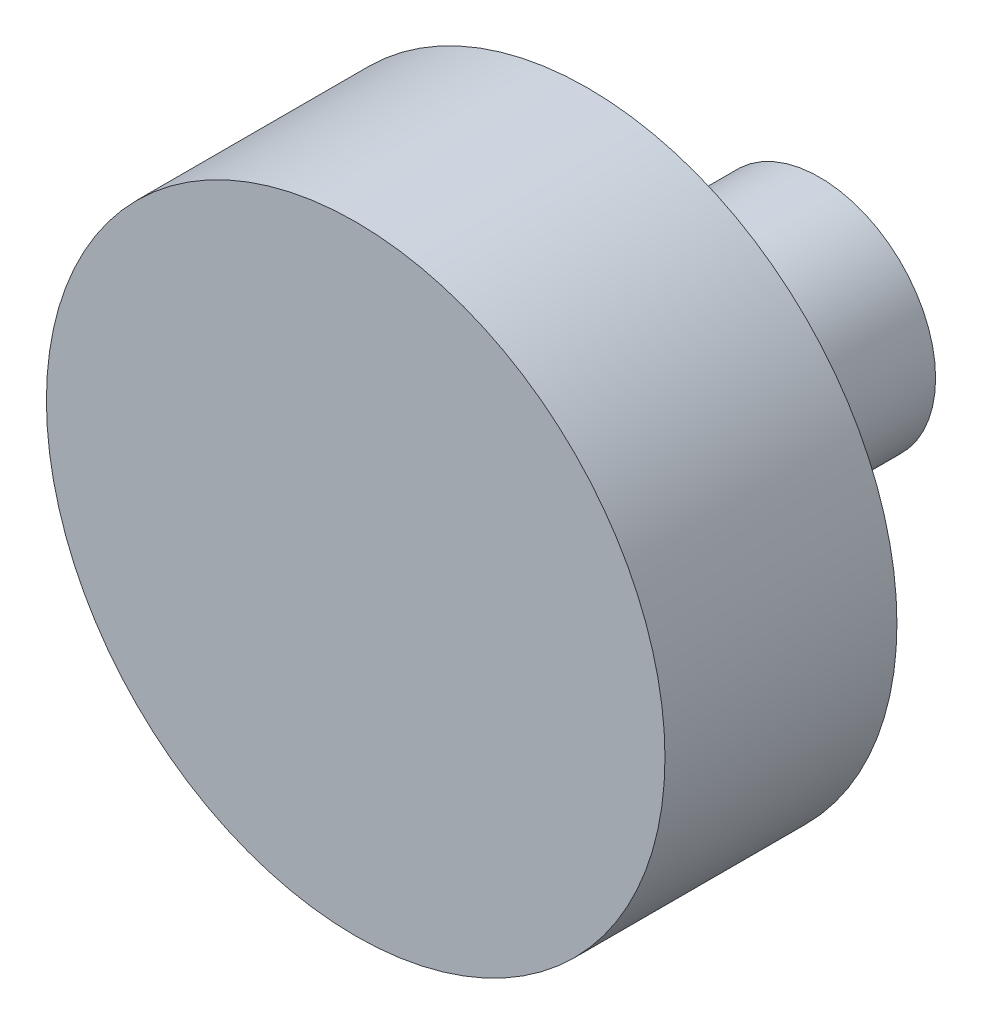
ISO-10303-21;
HEADER;
FILE_DESCRIPTION(('STEP AP214'),'2;1');
FILE_NAME('part.step','',(''),(''),'','','');
FILE_SCHEMA(('AUTOMOTIVE_DESIGN { 1 0 10303 214 1 1 1 1 }'));
ENDSEC;
DATA;
#1=APPLICATION_CONTEXT('core data for automotive mechanical design processes');
#2=APPLICATION_PROTOCOL_DEFINITION('international standard','automotive_design',2000,#1);
#3=PRODUCT_CONTEXT('',#1,'mechanical');
#4=PRODUCT('Part','Part','',(#3));
#5=PRODUCT_RELATED_PRODUCT_CATEGORY('part','',(#4));
#6=PRODUCT_DEFINITION_FORMATION('','',#4);
#7=PRODUCT_DEFINITION_CONTEXT('part definition',#1,'design');
#8=PRODUCT_DEFINITION('design','',#6,#7);
#9=PRODUCT_DEFINITION_SHAPE('','',#8);
#10=(LENGTH_UNIT() NAMED_UNIT(*) SI_UNIT(.MILLI.,.METRE.));
#11=(NAMED_UNIT(*) PLANE_ANGLE_UNIT() SI_UNIT($,.RADIAN.));
#12=(NAMED_UNIT(*) SI_UNIT($,.STERADIAN.) SOLID_ANGLE_UNIT());
#13=UNCERTAINTY_MEASURE_WITH_UNIT(LENGTH_MEASURE(1.E-05),#10,'distance_accuracy_value','');
#14=(GEOMETRIC_REPRESENTATION_CONTEXT(3) GLOBAL_UNCERTAINTY_ASSIGNED_CONTEXT((#13)) GLOBAL_UNIT_ASSIGNED_CONTEXT((#10,
#11,#12)) REPRESENTATION_CONTEXT('',''));
#15=CARTESIAN_POINT('',(0.,0.,0.));
#16=DIRECTION('',(0.,0.,1.));
#17=DIRECTION('',(1.,0.,0.));
#18=AXIS2_PLACEMENT_3D('',#15,#16,#17);
#19=CARTESIAN_POINT('',(0.,0.,76.2));
#20=DIRECTION('',(0.,0.,-1.));
#21=DIRECTION('',(-1.,0.,0.));
#22=AXIS2_PLACEMENT_3D('',#19,#20,#21);
#23=CYLINDRICAL_SURFACE('',#22,101.6);
#24=CARTESIAN_POINT('',(0.,0.,76.2));
#25=DIRECTION('',(0.,0.,1.));
#26=DIRECTION('',(1.,0.,0.));
#27=AXIS2_PLACEMENT_3D('',#24,#25,#26);
#28=CIRCLE('',#27,101.6);
#29=CARTESIAN_POINT('',(-101.6,0.,76.2));
#30=VERTEX_POINT('',#29);
#31=EDGE_CURVE('E10',#30,#30,#28,.T.);
#32=CARTESIAN_POINT('',(0.,0.,0.));
#33=DIRECTION('',(0.,0.,1.));
#34=DIRECTION('',(1.,0.,0.));
#35=AXIS2_PLACEMENT_3D('',#32,#33,#34);
#36=CIRCLE('',#35,101.6);
#37=CARTESIAN_POINT('',(-101.6,0.,0.));
#38=VERTEX_POINT('',#37);
#39=EDGE_CURVE('E40',#38,#38,#36,.T.);
#40=CARTESIAN_POINT('',(-101.6,0.,76.2));
#41=CARTESIAN_POINT('',(-101.6,0.,75.40625));
#42=CARTESIAN_POINT('',(-101.6,0.,74.6125));
#43=CARTESIAN_POINT('',(-101.6,0.,73.025));
#44=CARTESIAN_POINT('',(-101.6,0.,72.23125));
#45=CARTESIAN_POINT('',(-101.6,0.,70.64375));
#46=CARTESIAN_POINT('',(-101.6,0.,69.85));
#47=CARTESIAN_POINT('',(-101.6,0.,68.2625));
#48=CARTESIAN_POINT('',(-101.6,0.,67.46875));
#49=CARTESIAN_POINT('',(-101.6,0.,65.88125));
#50=CARTESIAN_POINT('',(-101.6,0.,65.0875));
#51=CARTESIAN_POINT('',(-101.6,0.,63.5));
#52=CARTESIAN_POINT('',(-101.6,0.,62.70625));
#53=CARTESIAN_POINT('',(-101.6,0.,61.11875));
#54=CARTESIAN_POINT('',(-101.6,0.,60.325));
#55=CARTESIAN_POINT('',(-101.6,0.,58.7375));
#56=CARTESIAN_POINT('',(-101.6,0.,57.94375));
#57=CARTESIAN_POINT('',(-101.6,0.,56.35625));
#58=CARTESIAN_POINT('',(-101.6,0.,55.5625));
#59=CARTESIAN_POINT('',(-101.6,0.,53.975));
#60=CARTESIAN_POINT('',(-101.6,0.,53.18125));
#61=CARTESIAN_POINT('',(-101.6,0.,51.59375));
#62=CARTESIAN_POINT('',(-101.6,0.,50.8));
#63=CARTESIAN_POINT('',(-101.6,0.,49.2125));
#64=CARTESIAN_POINT('',(-101.6,0.,48.41875));
#65=CARTESIAN_POINT('',(-101.6,0.,46.83125));
#66=CARTESIAN_POINT('',(-101.6,0.,46.0375));
#67=CARTESIAN_POINT('',(-101.6,0.,44.45));
#68=CARTESIAN_POINT('',(-101.6,0.,43.65625));
#69=CARTESIAN_POINT('',(-101.6,0.,42.06875));
#70=CARTESIAN_POINT('',(-101.6,0.,41.275));
#71=CARTESIAN_POINT('',(-101.6,0.,39.6875));
#72=CARTESIAN_POINT('',(-101.6,0.,38.89375));
#73=CARTESIAN_POINT('',(-101.6,0.,37.30625));
#74=CARTESIAN_POINT('',(-101.6,0.,36.5125));
#75=CARTESIAN_POINT('',(-101.6,0.,34.925));
#76=CARTESIAN_POINT('',(-101.6,0.,34.13125));
#77=CARTESIAN_POINT('',(-101.6,0.,32.54375));
#78=CARTESIAN_POINT('',(-101.6,0.,31.75));
#79=CARTESIAN_POINT('',(-101.6,0.,30.1625));
#80=CARTESIAN_POINT('',(-101.6,0.,29.36875));
#81=CARTESIAN_POINT('',(-101.6,0.,27.78125));
#82=CARTESIAN_POINT('',(-101.6,0.,26.9875));
#83=CARTESIAN_POINT('',(-101.6,0.,25.4));
#84=CARTESIAN_POINT('',(-101.6,0.,24.60625));
#85=CARTESIAN_POINT('',(-101.6,0.,23.01875));
#86=CARTESIAN_POINT('',(-101.6,0.,22.225));
#87=CARTESIAN_POINT('',(-101.6,0.,20.6375));
#88=CARTESIAN_POINT('',(-101.6,0.,19.84375));
#89=CARTESIAN_POINT('',(-101.6,0.,18.25625));
#90=CARTESIAN_POINT('',(-101.6,0.,17.4625));
#91=CARTESIAN_POINT('',(-101.6,0.,15.875));
#92=CARTESIAN_POINT('',(-101.6,0.,15.08125));
#93=CARTESIAN_POINT('',(-101.6,0.,13.49375));
#94=CARTESIAN_POINT('',(-101.6,0.,12.7));
#95=CARTESIAN_POINT('',(-101.6,0.,11.1125));
#96=CARTESIAN_POINT('',(-101.6,0.,10.31875));
#97=CARTESIAN_POINT('',(-101.6,0.,8.73125));
#98=CARTESIAN_POINT('',(-101.6,0.,7.93750000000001));
#99=CARTESIAN_POINT('',(-101.6,0.,6.35));
#100=CARTESIAN_POINT('',(-101.6,0.,5.55625));
#101=CARTESIAN_POINT('',(-101.6,0.,3.96875));
#102=CARTESIAN_POINT('',(-101.6,0.,3.175));
#103=CARTESIAN_POINT('',(-101.6,0.,1.5875));
#104=CARTESIAN_POINT('',(-101.6,0.,0.793750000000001));
#105=CARTESIAN_POINT('',(-101.6,0.,0.));
#106=B_SPLINE_CURVE_WITH_KNOTS('',3,(#40,#41,#42,#43,#44,#45,#46,#47,#48,#49,#50,#51,#52,#53,
#54,#55,#56,#57,#58,#59,#60,#61,#62,#63,#64,#65,#66,#67,#68,#69,#70,#71,#72,#73,#74,#75,#76,#77,
#78,#79,#80,#81,#82,#83,#84,#85,#86,#87,#88,#89,#90,#91,#92,#93,#94,#95,#96,#97,#98,#99,#100,
#101,#102,#103,#104,#105),.UNSPECIFIED.,.F.,.F.,(4,2,2,2,2,2,2,2,2,2,2,2,2,2,2,2,2,2,2,2,2,2,2,
2,2,2,2,2,2,2,2,2,4),(0.,2.38125,4.7625,7.14375,9.52500000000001,11.90625,14.2875,16.66875,
19.05,21.43125,23.8125,26.19375,28.575,30.95625,33.3375,35.71875,38.1,40.48125,42.8625,45.24375,
47.625,50.00625,52.3875,54.76875,57.15,59.53125,61.9125,64.29375,66.675,69.05625,71.4375,
73.81875,76.2),.UNSPECIFIED.);
#107=EDGE_CURVE('BSEAM37',#30,#38,#106,.T.);
#108=ORIENTED_EDGE('',*,*,#31,.F.);
#109=ORIENTED_EDGE('',*,*,#39,.T.);
#110=ORIENTED_EDGE('',*,*,#107,.T.);
#111=ORIENTED_EDGE('',*,*,#107,.F.);
#112=EDGE_LOOP('',(#108,#110,#109,#111));
#113=FACE_BOUND('',#112,.T.);
#114=ADVANCED_FACE('F37',(#113),#23,.T.);
#115=CARTESIAN_POINT('',(0.,0.,76.2));
#116=DIRECTION('',(0.,0.,1.));
#117=DIRECTION('',(1.,0.,0.));
#118=AXIS2_PLACEMENT_3D('',#115,#116,#117);
#119=PLANE('',#118);
#120=ORIENTED_EDGE('',*,*,#31,.T.);
#121=EDGE_LOOP('',(#120));
#122=FACE_BOUND('',#121,.T.);
#123=ADVANCED_FACE('F71',(#122),#119,.T.);
#124=CARTESIAN_POINT('',(0.,0.,0.));
#125=DIRECTION('',(0.,0.,1.));
#126=DIRECTION('',(1.,0.,0.));
#127=AXIS2_PLACEMENT_3D('',#124,#125,#126);
#128=PLANE('',#127);
#129=CARTESIAN_POINT('',(0.,0.,0.));
#130=DIRECTION('',(0.,0.,1.));
#131=DIRECTION('',(1.,0.,0.));
#132=AXIS2_PLACEMENT_3D('',#129,#130,#131);
#133=CIRCLE('',#132,38.1);
#134=CARTESIAN_POINT('',(38.1,0.,0.));
#135=VERTEX_POINT('',#134);
#136=EDGE_CURVE('E51',#135,#135,#133,.T.);
#137=ORIENTED_EDGE('',*,*,#136,.T.);
#138=EDGE_LOOP('',(#137));
#139=FACE_BOUND('',#138,.T.);
#140=ORIENTED_EDGE('',*,*,#39,.F.);
#141=EDGE_LOOP('',(#140));
#142=FACE_BOUND('',#141,.T.);
#143=ADVANCED_FACE('F68',(#139,#142),#128,.F.);
#144=CARTESIAN_POINT('',(0.,0.,-76.2));
#145=DIRECTION('',(0.,0.,1.));
#146=DIRECTION('',(1.,0.,0.));
#147=AXIS2_PLACEMENT_3D('',#144,#145,#146);
#148=CYLINDRICAL_SURFACE('',#147,38.1);
#149=CARTESIAN_POINT('',(0.,0.,-76.2));
#150=DIRECTION('',(0.,0.,1.));
#151=DIRECTION('',(1.,0.,0.));
#152=AXIS2_PLACEMENT_3D('',#149,#150,#151);
#153=CIRCLE('',#152,38.1);
#154=CARTESIAN_POINT('',(38.1,0.,-76.2));
#155=VERTEX_POINT('',#154);
#156=EDGE_CURVE('E49',#155,#155,#153,.T.);
#157=CARTESIAN_POINT('',(38.1,0.,-76.2));
#158=CARTESIAN_POINT('',(38.1,0.,-75.40625));
#159=CARTESIAN_POINT('',(38.1,0.,-74.6125));
#160=CARTESIAN_POINT('',(38.1,0.,-73.025));
#161=CARTESIAN_POINT('',(38.1,0.,-72.23125));
#162=CARTESIAN_POINT('',(38.1,0.,-70.64375));
#163=CARTESIAN_POINT('',(38.1,0.,-69.85));
#164=CARTESIAN_POINT('',(38.1,0.,-68.2625));
#165=CARTESIAN_POINT('',(38.1,0.,-67.46875));
#166=CARTESIAN_POINT('',(38.1,0.,-65.88125));
#167=CARTESIAN_POINT('',(38.1,0.,-65.0875));
#168=CARTESIAN_POINT('',(38.1,0.,-63.5));
#169=CARTESIAN_POINT('',(38.1,0.,-62.70625));
#170=CARTESIAN_POINT('',(38.1,0.,-61.11875));
#171=CARTESIAN_POINT('',(38.1,0.,-60.325));
#172=CARTESIAN_POINT('',(38.1,0.,-58.7375));
#173=CARTESIAN_POINT('',(38.1,0.,-57.94375));
#174=CARTESIAN_POINT('',(38.1,0.,-56.35625));
#175=CARTESIAN_POINT('',(38.1,0.,-55.5625));
#176=CARTESIAN_POINT('',(38.1,0.,-53.975));
#177=CARTESIAN_POINT('',(38.1,0.,-53.18125));
#178=CARTESIAN_POINT('',(38.1,0.,-51.59375));
#179=CARTESIAN_POINT('',(38.1,0.,-50.8));
#180=CARTESIAN_POINT('',(38.1,0.,-49.2125));
#181=CARTESIAN_POINT('',(38.1,0.,-48.41875));
#182=CARTESIAN_POINT('',(38.1,0.,-46.83125));
#183=CARTESIAN_POINT('',(38.1,0.,-46.0375));
#184=CARTESIAN_POINT('',(38.1,0.,-44.45));
#185=CARTESIAN_POINT('',(38.1,0.,-43.65625));
#186=CARTESIAN_POINT('',(38.1,0.,-42.06875));
#187=CARTESIAN_POINT('',(38.1,0.,-41.275));
#188=CARTESIAN_POINT('',(38.1,0.,-39.6875));
#189=CARTESIAN_POINT('',(38.1,0.,-38.89375));
#190=CARTESIAN_POINT('',(38.1,0.,-37.30625));
#191=CARTESIAN_POINT('',(38.1,0.,-36.5125));
#192=CARTESIAN_POINT('',(38.1,0.,-34.925));
#193=CARTESIAN_POINT('',(38.1,0.,-34.13125));
#194=CARTESIAN_POINT('',(38.1,0.,-32.54375));
#195=CARTESIAN_POINT('',(38.1,0.,-31.75));
#196=CARTESIAN_POINT('',(38.1,0.,-30.1625));
#197=CARTESIAN_POINT('',(38.1,0.,-29.36875));
#198=CARTESIAN_POINT('',(38.1,0.,-27.78125));
#199=CARTESIAN_POINT('',(38.1,0.,-26.9875));
#200=CARTESIAN_POINT('',(38.1,0.,-25.4));
#201=CARTESIAN_POINT('',(38.1,0.,-24.60625));
#202=CARTESIAN_POINT('',(38.1,0.,-23.01875));
#203=CARTESIAN_POINT('',(38.1,0.,-22.225));
#204=CARTESIAN_POINT('',(38.1,0.,-20.6375));
#205=CARTESIAN_POINT('',(38.1,0.,-19.84375));
#206=CARTESIAN_POINT('',(38.1,0.,-18.25625));
#207=CARTESIAN_POINT('',(38.1,0.,-17.4625));
#208=CARTESIAN_POINT('',(38.1,0.,-15.875));
#209=CARTESIAN_POINT('',(38.1,0.,-15.08125));
#210=CARTESIAN_POINT('',(38.1,0.,-13.49375));
#211=CARTESIAN_POINT('',(38.1,0.,-12.7));
#212=CARTESIAN_POINT('',(38.1,0.,-11.1125));
#213=CARTESIAN_POINT('',(38.1,0.,-10.31875));
#214=CARTESIAN_POINT('',(38.1,0.,-8.73125));
#215=CARTESIAN_POINT('',(38.1,0.,-7.93750000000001));
#216=CARTESIAN_POINT('',(38.1,0.,-6.35));
#217=CARTESIAN_POINT('',(38.1,0.,-5.55625));
#218=CARTESIAN_POINT('',(38.1,0.,-3.96875));
#219=CARTESIAN_POINT('',(38.1,0.,-3.175));
#220=CARTESIAN_POINT('',(38.1,0.,-1.5875));
#221=CARTESIAN_POINT('',(38.1,0.,-0.793750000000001));
#222=CARTESIAN_POINT('',(38.1,0.,0.));
#223=B_SPLINE_CURVE_WITH_KNOTS('',3,(#157,#158,#159,#160,#161,#162,#163,#164,#165,#166,#167,
#168,#169,#170,#171,#172,#173,#174,#175,#176,#177,#178,#179,#180,#181,#182,#183,#184,#185,#186,
#187,#188,#189,#190,#191,#192,#193,#194,#195,#196,#197,#198,#199,#200,#201,#202,#203,#204,#205,
#206,#207,#208,#209,#210,#211,#212,#213,#214,#215,#216,#217,#218,#219,#220,#221,#222),
.UNSPECIFIED.,.F.,.F.,(4,2,2,2,2,2,2,2,2,2,2,2,2,2,2,2,2,2,2,2,2,2,2,2,2,2,2,2,2,2,2,2,4),(0.,
2.38124999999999,4.76249999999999,7.14374999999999,9.52499999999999,11.90625,14.2875,16.66875,
19.05,21.43125,23.8125,26.19375,28.575,30.95625,33.3375,35.71875,38.1,40.48125,42.8625,45.24375,
47.625,50.00625,52.3875,54.76875,57.15,59.53125,61.9125,64.29375,66.675,69.05625,71.4375,
73.81875,76.2),.UNSPECIFIED.);
#224=EDGE_CURVE('BSEAM59',#155,#135,#223,.T.);
#225=ORIENTED_EDGE('',*,*,#156,.T.);
#226=ORIENTED_EDGE('',*,*,#136,.F.);
#227=ORIENTED_EDGE('',*,*,#224,.T.);
#228=ORIENTED_EDGE('',*,*,#224,.F.);
#229=EDGE_LOOP('',(#225,#227,#226,#228));
#230=FACE_BOUND('',#229,.T.);
#231=ADVANCED_FACE('F59',(#230),#148,.T.);
#232=CARTESIAN_POINT('',(0.,0.,-76.2));
#233=DIRECTION('',(0.,0.,1.));
#234=DIRECTION('',(1.,0.,0.));
#235=AXIS2_PLACEMENT_3D('',#232,#233,#234);
#236=PLANE('',#235);
#237=ORIENTED_EDGE('',*,*,#156,.F.);
#238=EDGE_LOOP('',(#237));
#239=FACE_BOUND('',#238,.T.);
#240=ADVANCED_FACE('F62',(#239),#236,.F.);
#241=CLOSED_SHELL('',(#114,#123,#143,#231,#240));
#242=MANIFOLD_SOLID_BREP('B2',#241);
#243=ADVANCED_BREP_SHAPE_REPRESENTATION('',(#18,#242),#14);
#244=SHAPE_DEFINITION_REPRESENTATION(#9,#243);
ENDSEC;
END-ISO-10303-21;
